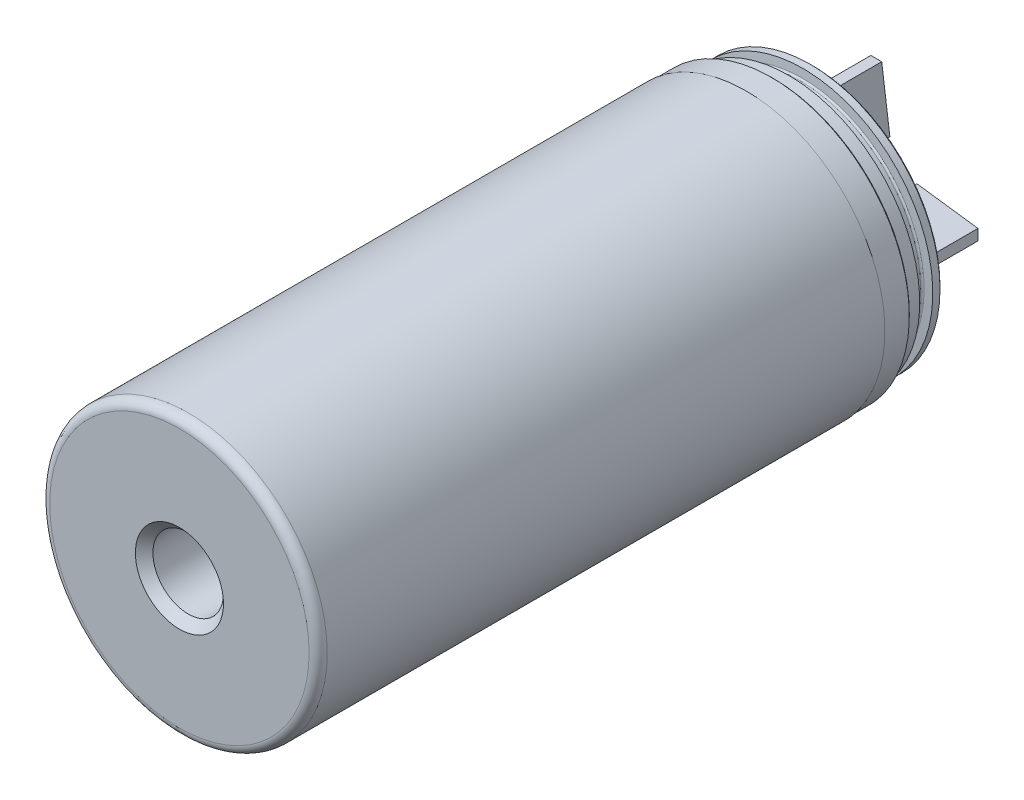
from build123d import *

# Parameters (mm, degrees)
SKETCH1_R                          = 19.4945
BODY_DEPTH                         = 88.9
FILLET1_R                          = 1.27
F_7_16_20_TAPPED_HOLE1_D           = 9.92124
F_7_16_20_TAPPED_HOLE1_DEPTH       = 28.702
F_7_16_20_TAPPED_HOLE1_CSINK_D     = 12.3825
F_7_16_20_TAPPED_HOLE1_CSINK_ANGLE = 90
SKETCH4_R                          = 19.4945
SKETCH4_R_2                        = 18.415
ORING_BOSS_REAR_DEPTH              = 5.461
SKETCH13_R                         = 18.415
SKETCH13_R_2                       = 18.2245
ORING_BOSS_FRONT_DEPTH             = 3.302
SKETCH7_R                          = 19.4945
SKETCH7_R_2                        = 19.3675
F_1_1_2_18_THREAD_DEPTH            = 3.81
CHAMFER1_SIZE                      = 0.254
SKETCH10_R                         = 1.397
PUMP_SHAFT_DEPTH                   = 10.668
CHAMFER2_SIZE                      = 0.254
IMPELLER_DEPTH                     = 0.762
CIRPATTERN3_COUNT                  = 4
CHAMFER3_SIZE                      = 0.254


with BuildPart() as part:
    # Sketch1 → body (new body)
    with BuildSketch(Plane.XY):
        Circle(SKETCH1_R)
    extrude(amount=BODY_DEPTH)

    # Fillet1
    fillet1_edges = [part.edges().sort_by_distance(p)[0] for p in [
        (-19.4945, 0, 88.9),
    ]]
    fillet(fillet1_edges, radius=FILLET1_R)

    # 7_16-20 Tapped Hole1
    with Locations(Plane.XY.offset(88.9)):
        with Locations((0, 0)):
            CounterSinkHole(F_7_16_20_TAPPED_HOLE1_D / 2, F_7_16_20_TAPPED_HOLE1_CSINK_D / 2, depth=F_7_16_20_TAPPED_HOLE1_DEPTH, counter_sink_angle=F_7_16_20_TAPPED_HOLE1_CSINK_ANGLE)

    # Sketch4 → oring boss rear (cut)
    with BuildSketch(Plane(origin=(0, 0, 0), x_dir=(-1, 0, 0), z_dir=(0, 0, -1))):
        Circle(SKETCH4_R)
        Circle(SKETCH4_R_2, mode=Mode.SUBTRACT)
    extrude(amount=-ORING_BOSS_REAR_DEPTH, mode=Mode.SUBTRACT)

    # Sketch13 → oring boss front (cut)
    with BuildSketch(Plane(origin=(0, 0, 0), x_dir=(-1, 0, 0), z_dir=(0, 0, -1))):
        Circle(SKETCH13_R)
        Circle(SKETCH13_R_2, mode=Mode.SUBTRACT)
    extrude(amount=-ORING_BOSS_FRONT_DEPTH, mode=Mode.SUBTRACT)

    # Sketch6 → Groove for AS 568-027_ O-Ring1 (revolve, cut)
    with BuildSketch(Plane(origin=(0, 0, 5.461), x_dir=(0, 1, 0), z_dir=(-1, 0, 0)), mode=Mode.PRIVATE) as groove_for_as_568_027_o_ring1_sk:
        with BuildLine():
            Line((17.097462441, 4.09239699), (18.2245, 4.191))
            Line((18.2245, 4.191), (18.2245, 2.159))
            Line((18.2245, 2.159), (17.097462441, 2.25760301))
            ThreePointArc((17.097462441, 2.25760301), (16.932331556, 2.33903655), (16.8656, 2.510636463))
            Line((16.8656, 2.510636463), (16.8656, 3.839363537))
            ThreePointArc((16.8656, 3.839363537), (16.932331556, 4.01096345), (17.097462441, 4.09239699))
        make_face()
    revolve(groove_for_as_568_027_o_ring1_sk.sketch.rotate(Axis((0, 0, -44.539), (0, 0, 1)), 180), axis=Axis((0, 0, -44.539), (0, 0, 1)), mode=Mode.SUBTRACT)

    # Sketch7 → 1-1_2-18 thread (cut)
    with BuildSketch(Plane(origin=(0, 0, 5.461), x_dir=(-1, 0, 0), z_dir=(0, 0, -1))):
        Circle(SKETCH7_R)
        Circle(SKETCH7_R_2, mode=Mode.SUBTRACT)
    extrude(amount=-F_1_1_2_18_THREAD_DEPTH, mode=Mode.SUBTRACT)

    # Chamfer1
    chamfer1_edges = [part.edges().sort_by_distance(p)[0] for p in [
        (19.3675, 0, 5.461),
    ]]
    chamfer(chamfer1_edges, length=CHAMFER1_SIZE)

    # Sketch10 → pump shaft (add)
    with BuildSketch(Plane(origin=(0, 0, 0), x_dir=(-1, 0, 0), z_dir=(0, 0, -1))):
        with Locations(Location((0, 0, 0), (0, 0, 180))):
            Circle(SKETCH10_R)
    extrude(amount=PUMP_SHAFT_DEPTH)

    # Chamfer2
    chamfer2_edges = [part.edges().sort_by_distance(p)[0] for p in [
        (-1.397, 0, -10.668),
    ]]
    chamfer(chamfer2_edges, length=CHAMFER2_SIZE)

    # Sketch11 → hub (revolve)
    with BuildSketch(Plane(origin=(0, 0, 0), x_dir=(0, 0, -1), z_dir=(1, 0, 0)), mode=Mode.PRIVATE) as hub_sk:
        Polygon((0.508, 0), (7.62, 0), (7.62, 4.7625), (4.445, 4.7625), (3.302, 6.096), (0.508, 6.096), align=None)
    revolve(hub_sk.sketch.rotate(Axis((0, 0, -20.601139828), (0, 0, 1)), 90), axis=Axis((0, 0, -20.601139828), (0, 0, 1)))

    # Sketch12 → impeller (add, symmetric)
    with BuildSketch(Plane(origin=(0, 0, 0), x_dir=(0, 0, -1), z_dir=(1, 0, 0))):
        Polygon((0.508, 0), (0.508, 14.2875), (9.017, 14.2875), (10.16, 4.572), (7.62, 4.572), (7.62, 0), align=None)
    impeller = extrude(amount=IMPELLER_DEPTH, both=True)

    # CirPattern3: impeller ×4 about axis
    cirpattern3_axis = Axis((0, 0, 0), (0, 0, 1))
    for i in range(1, CIRPATTERN3_COUNT):
        add(impeller.rotate(cirpattern3_axis, i * 360 / CIRPATTERN3_COUNT))

    # Chamfer3
    chamfer3_edges = [part.edges().sort_by_distance(p)[0] for p in [
        (18.2245, 0, 0),
    ]]
    chamfer(chamfer3_edges, length=CHAMFER3_SIZE)


solid = part.part
